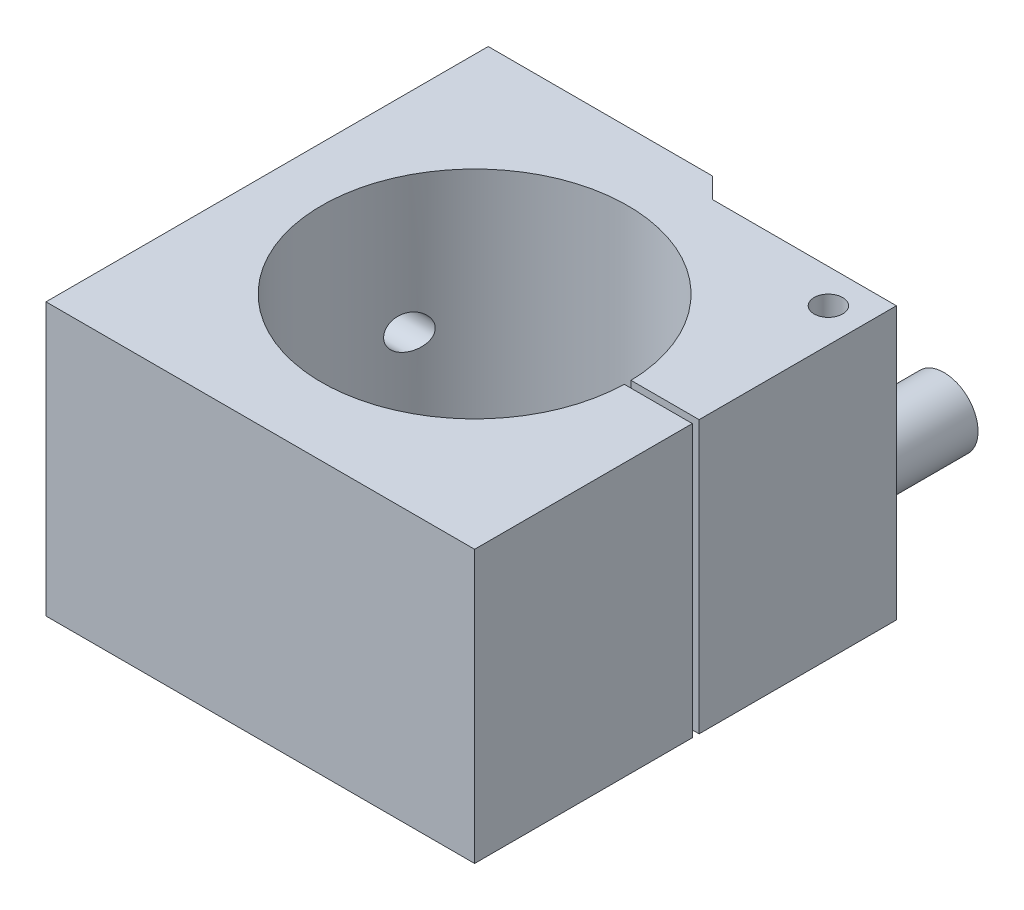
ISO-10303-21;
HEADER;
FILE_DESCRIPTION(('STEP AP214'),'2;1');
FILE_NAME('part.step','',(''),(''),'','','');
FILE_SCHEMA(('AUTOMOTIVE_DESIGN { 1 0 10303 214 1 1 1 1 }'));
ENDSEC;
DATA;
#1=APPLICATION_CONTEXT('core data for automotive mechanical design processes');
#2=APPLICATION_PROTOCOL_DEFINITION('international standard','automotive_design',2000,#1);
#3=PRODUCT_CONTEXT('',#1,'mechanical');
#4=PRODUCT('Part','Part','',(#3));
#5=PRODUCT_RELATED_PRODUCT_CATEGORY('part','',(#4));
#6=PRODUCT_DEFINITION_FORMATION('','',#4);
#7=PRODUCT_DEFINITION_CONTEXT('part definition',#1,'design');
#8=PRODUCT_DEFINITION('design','',#6,#7);
#9=PRODUCT_DEFINITION_SHAPE('','',#8);
#10=(LENGTH_UNIT() NAMED_UNIT(*) SI_UNIT(.MILLI.,.METRE.));
#11=(NAMED_UNIT(*) PLANE_ANGLE_UNIT() SI_UNIT($,.RADIAN.));
#12=(NAMED_UNIT(*) SI_UNIT($,.STERADIAN.) SOLID_ANGLE_UNIT());
#13=UNCERTAINTY_MEASURE_WITH_UNIT(LENGTH_MEASURE(1.E-05),#10,'distance_accuracy_value','');
#14=(GEOMETRIC_REPRESENTATION_CONTEXT(3) GLOBAL_UNCERTAINTY_ASSIGNED_CONTEXT((#13)) GLOBAL_UNIT_ASSIGNED_CONTEXT((#10,
#11,#12)) REPRESENTATION_CONTEXT('',''));
#15=CARTESIAN_POINT('',(0.,0.,0.));
#16=DIRECTION('',(0.,0.,1.));
#17=DIRECTION('',(1.,0.,0.));
#18=AXIS2_PLACEMENT_3D('',#15,#16,#17);
#19=CARTESIAN_POINT('',(32.5,40.,32.5));
#20=DIRECTION('',(-1.,0.,0.));
#21=DIRECTION('',(0.,0.,1.));
#22=AXIS2_PLACEMENT_3D('',#19,#20,#21);
#23=PLANE('',#22);
#24=DIRECTION('',(0.,-1.,0.));
#25=VECTOR('',#24,1.);
#26=CARTESIAN_POINT('',(32.5,40.,-29.5));
#27=LINE('',#26,#25);
#28=CARTESIAN_POINT('',(32.5,40.,-29.5));
#29=VERTEX_POINT('',#28);
#30=CARTESIAN_POINT('',(32.5,0.,-29.5));
#31=VERTEX_POINT('',#30);
#32=EDGE_CURVE('E280',#29,#31,#27,.T.);
#33=ORIENTED_EDGE('',*,*,#32,.F.);
#34=DIRECTION('',(0.,0.,-1.));
#35=VECTOR('',#34,1.);
#36=CARTESIAN_POINT('',(32.5,40.,32.5));
#37=LINE('',#36,#35);
#38=CARTESIAN_POINT('',(32.5,40.,-0.500000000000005));
#39=VERTEX_POINT('',#38);
#40=EDGE_CURVE('E270',#39,#29,#37,.T.);
#41=ORIENTED_EDGE('',*,*,#40,.F.);
#42=DIRECTION('',(0.,1.,0.));
#43=VECTOR('',#42,1.);
#44=CARTESIAN_POINT('',(32.5,0.,-0.500000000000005));
#45=LINE('',#44,#43);
#46=CARTESIAN_POINT('',(32.5,0.,-0.500000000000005));
#47=VERTEX_POINT('',#46);
#48=EDGE_CURVE('E311',#47,#39,#45,.T.);
#49=ORIENTED_EDGE('',*,*,#48,.F.);
#50=DIRECTION('',(0.,0.,-1.));
#51=VECTOR('',#50,1.);
#52=CARTESIAN_POINT('',(32.5,0.,32.5));
#53=LINE('',#52,#51);
#54=EDGE_CURVE('E258',#47,#31,#53,.T.);
#55=ORIENTED_EDGE('',*,*,#54,.T.);
#56=EDGE_LOOP('',(#33,#41,#49,#55));
#57=FACE_BOUND('',#56,.T.);
#58=ADVANCED_FACE('F41',(#57),#23,.F.);
#59=CARTESIAN_POINT('',(-32.5,40.,-32.5));
#60=DIRECTION('',(0.,0.,1.));
#61=DIRECTION('',(1.,0.,0.));
#62=AXIS2_PLACEMENT_3D('',#59,#60,#61);
#63=PLANE('',#62);
#64=DIRECTION('',(-1.,0.,0.));
#65=VECTOR('',#64,1.);
#66=CARTESIAN_POINT('',(-32.5,40.,-32.5));
#67=LINE('',#66,#65);
#68=CARTESIAN_POINT('',(2.49999999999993,40.,-32.5));
#69=VERTEX_POINT('',#68);
#70=CARTESIAN_POINT('',(-30.5,40.,-32.5));
#71=VERTEX_POINT('',#70);
#72=EDGE_CURVE('E120',#69,#71,#67,.T.);
#73=ORIENTED_EDGE('',*,*,#72,.F.);
#74=DIRECTION('',(0.,-1.,0.));
#75=VECTOR('',#74,1.);
#76=CARTESIAN_POINT('',(2.49999999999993,40.,-32.5));
#77=LINE('',#76,#75);
#78=CARTESIAN_POINT('',(2.49999999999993,0.,-32.5));
#79=VERTEX_POINT('',#78);
#80=EDGE_CURVE('E275',#69,#79,#77,.T.);
#81=ORIENTED_EDGE('',*,*,#80,.T.);
#82=DIRECTION('',(-1.,0.,0.));
#83=VECTOR('',#82,1.);
#84=CARTESIAN_POINT('',(-32.5,0.,-32.5));
#85=LINE('',#84,#83);
#86=CARTESIAN_POINT('',(-30.5,0.,-32.5));
#87=VERTEX_POINT('',#86);
#88=EDGE_CURVE('E136',#79,#87,#85,.T.);
#89=ORIENTED_EDGE('',*,*,#88,.T.);
#90=DIRECTION('',(0.,-1.,0.));
#91=VECTOR('',#90,1.);
#92=CARTESIAN_POINT('',(-30.5,40.,-32.5));
#93=LINE('',#92,#91);
#94=EDGE_CURVE('E133',#71,#87,#93,.T.);
#95=ORIENTED_EDGE('',*,*,#94,.F.);
#96=EDGE_LOOP('',(#73,#81,#89,#95));
#97=FACE_BOUND('',#96,.T.);
#98=ADVANCED_FACE('F134',(#97),#63,.F.);
#99=CARTESIAN_POINT('',(-32.5,40.,32.5));
#100=DIRECTION('',(0.,0.,-1.));
#101=DIRECTION('',(-1.,0.,0.));
#102=AXIS2_PLACEMENT_3D('',#99,#100,#101);
#103=PLANE('',#102);
#104=DIRECTION('',(1.,0.,0.));
#105=VECTOR('',#104,1.);
#106=CARTESIAN_POINT('',(-32.5,40.,32.5));
#107=LINE('',#106,#105);
#108=CARTESIAN_POINT('',(-30.5,40.,32.5));
#109=VERTEX_POINT('',#108);
#110=CARTESIAN_POINT('',(32.5,40.,32.5));
#111=VERTEX_POINT('',#110);
#112=EDGE_CURVE('E129',#109,#111,#107,.T.);
#113=ORIENTED_EDGE('',*,*,#112,.F.);
#114=DIRECTION('',(0.,1.,0.));
#115=VECTOR('',#114,1.);
#116=CARTESIAN_POINT('',(-30.5,0.,32.5));
#117=LINE('',#116,#115);
#118=CARTESIAN_POINT('',(-30.5,0.,32.5));
#119=VERTEX_POINT('',#118);
#120=EDGE_CURVE('E147',#119,#109,#117,.T.);
#121=ORIENTED_EDGE('',*,*,#120,.F.);
#122=DIRECTION('',(1.,0.,0.));
#123=VECTOR('',#122,1.);
#124=CARTESIAN_POINT('',(-32.5,0.,32.5));
#125=LINE('',#124,#123);
#126=CARTESIAN_POINT('',(32.5,0.,32.5));
#127=VERTEX_POINT('',#126);
#128=EDGE_CURVE('E262',#119,#127,#125,.T.);
#129=ORIENTED_EDGE('',*,*,#128,.T.);
#130=DIRECTION('',(0.,-1.,0.));
#131=VECTOR('',#130,1.);
#132=CARTESIAN_POINT('',(32.5,40.,32.5));
#133=LINE('',#132,#131);
#134=EDGE_CURVE('E255',#111,#127,#133,.T.);
#135=ORIENTED_EDGE('',*,*,#134,.F.);
#136=EDGE_LOOP('',(#113,#121,#129,#135));
#137=FACE_BOUND('',#136,.T.);
#138=ADVANCED_FACE('F235',(#137),#103,.F.);
#139=CARTESIAN_POINT('',(0.,40.,0.));
#140=DIRECTION('',(0.,-1.,0.));
#141=DIRECTION('',(0.,0.,-1.));
#142=AXIS2_PLACEMENT_3D('',#139,#140,#141);
#143=PLANE('',#142);
#144=CARTESIAN_POINT('',(27.5,40.,-24.5));
#145=DIRECTION('',(0.,1.,0.));
#146=DIRECTION('',(0.,0.,1.));
#147=AXIS2_PLACEMENT_3D('',#144,#145,#146);
#148=CIRCLE('',#147,2.1);
#149=CARTESIAN_POINT('',(27.5,40.,-22.4));
#150=VERTEX_POINT('',#149);
#151=EDGE_CURVE('E343',#150,#150,#148,.T.);
#152=ORIENTED_EDGE('',*,*,#151,.F.);
#153=EDGE_LOOP('',(#152));
#154=FACE_BOUND('',#153,.T.);
#155=DIRECTION('',(1.,0.,0.));
#156=VECTOR('',#155,1.);
#157=CARTESIAN_POINT('',(32.5,40.,-29.5));
#158=LINE('',#157,#156);
#159=CARTESIAN_POINT('',(5.4999999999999,40.,-29.5));
#160=VERTEX_POINT('',#159);
#161=EDGE_CURVE('E279',#160,#29,#158,.T.);
#162=ORIENTED_EDGE('',*,*,#161,.F.);
#163=DIRECTION('',(0.707106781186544,0.,0.707106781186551));
#164=VECTOR('',#163,1.);
#165=CARTESIAN_POINT('',(12.5,40.,-22.4999999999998));
#166=LINE('',#165,#164);
#167=EDGE_CURVE('E126',#160,#69,#166,.F.);
#168=ORIENTED_EDGE('',*,*,#167,.T.);
#169=ORIENTED_EDGE('',*,*,#72,.T.);
#170=DIRECTION('',(0.,0.,-1.));
#171=VECTOR('',#170,1.);
#172=CARTESIAN_POINT('',(-30.5,40.,32.5));
#173=LINE('',#172,#171);
#174=EDGE_CURVE('E124',#109,#71,#173,.T.);
#175=ORIENTED_EDGE('',*,*,#174,.F.);
#176=ORIENTED_EDGE('',*,*,#112,.T.);
#177=CARTESIAN_POINT('',(32.5,40.,0.499999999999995));
#178=VERTEX_POINT('',#177);
#179=EDGE_CURVE('E130',#111,#178,#37,.T.);
#180=ORIENTED_EDGE('',*,*,#179,.T.);
#181=DIRECTION('',(1.,0.,0.));
#182=VECTOR('',#181,1.);
#183=CARTESIAN_POINT('',(-32.501,40.,0.499999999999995));
#184=LINE('',#183,#182);
#185=CARTESIAN_POINT('',(22.494443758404,40.,0.49999999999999));
#186=VERTEX_POINT('',#185);
#187=EDGE_CURVE('E307',#186,#178,#184,.T.);
#188=ORIENTED_EDGE('',*,*,#187,.F.);
#189=CARTESIAN_POINT('',(0.,40.,0.));
#190=DIRECTION('',(0.,1.,0.));
#191=DIRECTION('',(0.,0.,1.));
#192=AXIS2_PLACEMENT_3D('',#189,#190,#191);
#193=CIRCLE('',#192,22.5);
#194=CARTESIAN_POINT('',(22.494443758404,40.,-0.500000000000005));
#195=VERTEX_POINT('',#194);
#196=EDGE_CURVE('E265',#195,#186,#193,.T.);
#197=ORIENTED_EDGE('',*,*,#196,.F.);
#198=DIRECTION('',(1.,0.,0.));
#199=VECTOR('',#198,1.);
#200=CARTESIAN_POINT('',(-32.501,40.,-0.500000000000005));
#201=LINE('',#200,#199);
#202=EDGE_CURVE('E292',#195,#39,#201,.T.);
#203=ORIENTED_EDGE('',*,*,#202,.T.);
#204=ORIENTED_EDGE('',*,*,#40,.T.);
#205=EDGE_LOOP('',(#162,#168,#169,#175,#176,#180,#188,#197,#203,#204));
#206=FACE_BOUND('',#205,.T.);
#207=ADVANCED_FACE('F122',(#154,#206),#143,.F.);
#208=CARTESIAN_POINT('',(0.,0.,0.));
#209=DIRECTION('',(0.,-1.,0.));
#210=DIRECTION('',(0.,0.,-1.));
#211=AXIS2_PLACEMENT_3D('',#208,#209,#210);
#212=PLANE('',#211);
#213=DIRECTION('',(-0.707106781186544,0.,-0.707106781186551));
#214=VECTOR('',#213,1.);
#215=CARTESIAN_POINT('',(17.5,0.,-17.4999999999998));
#216=LINE('',#215,#214);
#217=CARTESIAN_POINT('',(5.4999999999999,0.,-29.5));
#218=VERTEX_POINT('',#217);
#219=EDGE_CURVE('E51',#79,#218,#216,.F.);
#220=ORIENTED_EDGE('',*,*,#219,.T.);
#221=DIRECTION('',(-1.,0.,0.));
#222=VECTOR('',#221,1.);
#223=CARTESIAN_POINT('',(32.5,0.,-29.5));
#224=LINE('',#223,#222);
#225=EDGE_CURVE('E57',#31,#218,#224,.T.);
#226=ORIENTED_EDGE('',*,*,#225,.F.);
#227=ORIENTED_EDGE('',*,*,#54,.F.);
#228=DIRECTION('',(1.,0.,0.));
#229=VECTOR('',#228,1.);
#230=CARTESIAN_POINT('',(-32.501,0.,-0.500000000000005));
#231=LINE('',#230,#229);
#232=CARTESIAN_POINT('',(22.494443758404,0.,-0.500000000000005));
#233=VERTEX_POINT('',#232);
#234=EDGE_CURVE('E314',#233,#47,#231,.T.);
#235=ORIENTED_EDGE('',*,*,#234,.F.);
#236=CARTESIAN_POINT('',(0.,0.,0.));
#237=DIRECTION('',(0.,-1.,0.));
#238=DIRECTION('',(0.,0.,-1.));
#239=AXIS2_PLACEMENT_3D('',#236,#237,#238);
#240=CIRCLE('',#239,22.5);
#241=CARTESIAN_POINT('',(22.494443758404,0.,0.49999999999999));
#242=VERTEX_POINT('',#241);
#243=EDGE_CURVE('E297',#233,#242,#240,.F.);
#244=ORIENTED_EDGE('',*,*,#243,.T.);
#245=DIRECTION('',(1.,0.,0.));
#246=VECTOR('',#245,1.);
#247=CARTESIAN_POINT('',(-32.501,0.,0.49999999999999));
#248=LINE('',#247,#246);
#249=CARTESIAN_POINT('',(32.5,0.,0.49999999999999));
#250=VERTEX_POINT('',#249);
#251=EDGE_CURVE('E310',#242,#250,#248,.T.);
#252=ORIENTED_EDGE('',*,*,#251,.T.);
#253=EDGE_CURVE('E250',#127,#250,#53,.T.);
#254=ORIENTED_EDGE('',*,*,#253,.F.);
#255=ORIENTED_EDGE('',*,*,#128,.F.);
#256=DIRECTION('',(0.,0.,1.));
#257=VECTOR('',#256,1.);
#258=CARTESIAN_POINT('',(-30.5,0.,-32.5));
#259=LINE('',#258,#257);
#260=EDGE_CURVE('E141',#87,#119,#259,.T.);
#261=ORIENTED_EDGE('',*,*,#260,.F.);
#262=ORIENTED_EDGE('',*,*,#88,.F.);
#263=EDGE_LOOP('',(#220,#226,#227,#235,#244,#252,#254,#255,#261,#262));
#264=FACE_BOUND('',#263,.T.);
#265=ADVANCED_FACE('F239',(#264),#212,.T.);
#266=ORIENTED_EDGE('',*,*,#253,.T.);
#267=DIRECTION('',(0.,-1.,0.));
#268=VECTOR('',#267,1.);
#269=CARTESIAN_POINT('',(32.5,40.,0.499999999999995));
#270=LINE('',#269,#268);
#271=EDGE_CURVE('E252',#178,#250,#270,.T.);
#272=ORIENTED_EDGE('',*,*,#271,.F.);
#273=ORIENTED_EDGE('',*,*,#179,.F.);
#274=ORIENTED_EDGE('',*,*,#134,.T.);
#275=EDGE_LOOP('',(#266,#272,#273,#274));
#276=FACE_BOUND('',#275,.T.);
#277=ADVANCED_FACE('F226',(#276),#23,.F.);
#278=CARTESIAN_POINT('',(0.,-0.001000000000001,0.));
#279=DIRECTION('',(0.,1.,0.));
#280=DIRECTION('',(0.,0.,1.));
#281=AXIS2_PLACEMENT_3D('',#278,#279,#280);
#282=CYLINDRICAL_SURFACE('',#281,22.5);
#283=CARTESIAN_POINT('',(-21.1231508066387,20.,-7.75));
#284=CARTESIAN_POINT('',(-21.12315005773,20.1335678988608,-7.75000416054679));
#285=CARTESIAN_POINT('',(-21.1192178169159,20.2671847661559,-7.76074551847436));
#286=CARTESIAN_POINT('',(-21.1035269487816,20.5305947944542,-7.80331001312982));
#287=CARTESIAN_POINT('',(-21.0917634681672,20.6603855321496,-7.83514622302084));
#288=CARTESIAN_POINT('',(-21.0605658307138,20.9122747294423,-7.91861950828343));
#289=CARTESIAN_POINT('',(-21.0411407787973,21.0343821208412,-7.97023307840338));
#290=CARTESIAN_POINT('',(-20.9948758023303,21.2678211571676,-8.09131448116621));
#291=CARTESIAN_POINT('',(-20.9680363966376,21.379153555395,-8.16078106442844));
#292=CARTESIAN_POINT('',(-20.9067240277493,21.5904642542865,-8.31661075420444));
#293=CARTESIAN_POINT('',(-20.8721113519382,21.690176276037,-8.40327921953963));
#294=CARTESIAN_POINT('',(-20.7961212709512,21.8735571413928,-8.58961312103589));
#295=CARTESIAN_POINT('',(-20.7547424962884,21.9572227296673,-8.68928118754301));
#296=CARTESIAN_POINT('',(-20.6633768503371,22.1113966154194,-8.90445145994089));
#297=CARTESIAN_POINT('',(-20.6130341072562,22.1808851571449,-9.02053198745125));
#298=CARTESIAN_POINT('',(-20.5065180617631,22.2995743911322,-9.26012526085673));
#299=CARTESIAN_POINT('',(-20.4503428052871,22.3487682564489,-9.38364049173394));
#300=CARTESIAN_POINT('',(-20.3283916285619,22.4298994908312,-9.64515199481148));
#301=CARTESIAN_POINT('',(-20.2622059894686,22.4600778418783,-9.78350215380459));
#302=CARTESIAN_POINT('',(-20.1257183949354,22.4968058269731,-10.0612846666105));
#303=CARTESIAN_POINT('',(-20.0554149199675,22.5033466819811,-10.2007174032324));
#304=CARTESIAN_POINT('',(-19.9057496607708,22.4930306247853,-10.4899935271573));
#305=CARTESIAN_POINT('',(-19.8261444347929,22.4739990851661,-10.6396349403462));
#306=CARTESIAN_POINT('',(-19.6660358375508,22.4096466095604,-10.9327478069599));
#307=CARTESIAN_POINT('',(-19.5855318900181,22.3643077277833,-11.0762149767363));
#308=CARTESIAN_POINT('',(-19.4214832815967,22.2449418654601,-11.3615400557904));
#309=CARTESIAN_POINT('',(-19.3380320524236,22.1694073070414,-11.5028249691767));
#310=CARTESIAN_POINT('',(-19.1763562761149,21.9910440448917,-11.770376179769));
#311=CARTESIAN_POINT('',(-19.098127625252,21.8882370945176,-11.8966543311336));
#312=CARTESIAN_POINT('',(-18.9654464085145,21.6792453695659,-12.1067832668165));
#313=CARTESIAN_POINT('',(-18.909327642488,21.5775992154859,-12.1941102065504));
#314=CARTESIAN_POINT('',(-18.805896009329,21.3585014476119,-12.3530261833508));
#315=CARTESIAN_POINT('',(-18.7585791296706,21.2410570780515,-12.424622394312));
#316=CARTESIAN_POINT('',(-18.6963581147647,21.0543186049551,-12.5178918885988));
#317=CARTESIAN_POINT('',(-18.6770065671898,20.989981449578,-12.5467296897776));
#318=CARTESIAN_POINT('',(-18.6417105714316,20.8583030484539,-12.5991119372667));
#319=CARTESIAN_POINT('',(-18.6257642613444,20.7909634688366,-12.6226592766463));
#320=CARTESIAN_POINT('',(-18.5976477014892,20.6538294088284,-12.664048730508));
#321=CARTESIAN_POINT('',(-18.5854749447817,20.5840365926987,-12.6818946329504));
#322=CARTESIAN_POINT('',(-18.5651938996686,20.442632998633,-12.7115652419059));
#323=CARTESIAN_POINT('',(-18.5570848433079,20.3710225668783,-12.7233910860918));
#324=CARTESIAN_POINT('',(-18.5409212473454,20.1752256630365,-12.7469455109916));
#325=CARTESIAN_POINT('',(-18.5370099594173,20.0498802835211,-12.7526191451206));
#326=CARTESIAN_POINT('',(-18.5421589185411,19.8001237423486,-12.7451304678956));
#327=CARTESIAN_POINT('',(-18.5512149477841,19.6757122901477,-12.731974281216));
#328=CARTESIAN_POINT('',(-18.5804771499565,19.4400632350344,-12.6892264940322));
#329=CARTESIAN_POINT('',(-18.5998799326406,19.328506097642,-12.6608182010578));
#330=CARTESIAN_POINT('',(-18.6480141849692,19.1121665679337,-12.5898131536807));
#331=CARTESIAN_POINT('',(-18.676747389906,19.007385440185,-12.5472137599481));
#332=CARTESIAN_POINT('',(-18.7443973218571,18.7990787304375,-12.445944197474));
#333=CARTESIAN_POINT('',(-18.7839073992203,18.696211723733,-12.3863228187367));
#334=CARTESIAN_POINT('',(-18.8699410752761,18.5018893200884,-12.2548560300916));
#335=CARTESIAN_POINT('',(-18.9164681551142,18.4104396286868,-12.1830045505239));
#336=CARTESIAN_POINT('',(-19.0223214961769,18.2266712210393,-12.0171696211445));
#337=CARTESIAN_POINT('',(-19.0825151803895,18.1363913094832,-11.9214818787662));
#338=CARTESIAN_POINT('',(-19.2074781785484,17.97299962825,-11.719085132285));
#339=CARTESIAN_POINT('',(-19.2722502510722,17.8998983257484,-11.6123694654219));
#340=CARTESIAN_POINT('',(-19.4145541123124,17.7615701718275,-11.3730943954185));
#341=CARTESIAN_POINT('',(-19.4925163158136,17.6992830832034,-11.2390844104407));
#342=CARTESIAN_POINT('',(-19.6493163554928,17.5992165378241,-10.9626482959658));
#343=CARTESIAN_POINT('',(-19.7281546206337,17.5614496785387,-10.8202178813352));
#344=CARTESIAN_POINT('',(-19.8906047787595,17.5094363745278,-10.5188088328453));
#345=CARTESIAN_POINT('',(-19.9741077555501,17.4972605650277,-10.3594071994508));
#346=CARTESIAN_POINT('',(-20.1370104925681,17.5037700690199,-10.0390778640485));
#347=CARTESIAN_POINT('',(-20.2164103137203,17.52245492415,-9.87815018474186));
#348=CARTESIAN_POINT('',(-20.3668396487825,17.5907143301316,-9.56406785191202));
#349=CARTESIAN_POINT('',(-20.4380304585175,17.6394928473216,-9.41081957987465));
#350=CARTESIAN_POINT('',(-20.5722680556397,17.7673361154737,-9.11363495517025));
#351=CARTESIAN_POINT('',(-20.6353198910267,17.846381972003,-8.96969285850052));
#352=CARTESIAN_POINT('',(-20.7462954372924,18.0251104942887,-8.70973233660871));
#353=CARTESIAN_POINT('',(-20.7950689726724,18.1223046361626,-8.59236724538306));
#354=CARTESIAN_POINT('',(-20.8832963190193,18.3386062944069,-8.37565758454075));
#355=CARTESIAN_POINT('',(-20.9227546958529,18.4577030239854,-8.27630419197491));
#356=CARTESIAN_POINT('',(-20.9883415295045,18.7024153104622,-8.10844726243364));
#357=CARTESIAN_POINT('',(-21.0153614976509,18.8264271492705,-8.03794825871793));
#358=CARTESIAN_POINT('',(-21.0605720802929,19.0859201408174,-7.91873728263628));
#359=CARTESIAN_POINT('',(-21.0787725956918,19.221388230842,-7.87000088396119));
#360=CARTESIAN_POINT('',(-21.1026533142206,19.4643142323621,-7.80569432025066));
#361=CARTESIAN_POINT('',(-21.11033369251,19.5702175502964,-7.78485900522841));
#362=CARTESIAN_POINT('',(-21.1205825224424,19.7840700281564,-7.7570107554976));
#363=CARTESIAN_POINT('',(-21.1231514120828,19.8920190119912,-7.74999663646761));
#364=CARTESIAN_POINT('',(-21.1231508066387,20.,-7.75));
#365=B_SPLINE_CURVE_WITH_KNOTS('',3,(#283,#284,#285,#286,#287,#288,#289,#290,#291,#292,#293,
#294,#295,#296,#297,#298,#299,#300,#301,#302,#303,#304,#305,#306,#307,#308,#309,#310,#311,#312,
#313,#314,#315,#316,#317,#318,#319,#320,#321,#322,#323,#324,#325,#326,#327,#328,#329,#330,#331,
#332,#333,#334,#335,#336,#337,#338,#339,#340,#341,#342,#343,#344,#345,#346,#347,#348,#349,#350,
#351,#352,#353,#354,#355,#356,#357,#358,#359,#360,#361,#362,#363,#364),.UNSPECIFIED.,.T.,.F.,(4,
2,2,2,2,2,2,2,2,2,2,2,2,2,2,2,2,2,2,2,2,2,2,2,2,2,2,2,2,2,2,2,2,2,2,2,2,2,2,2,4),(0.,
0.400305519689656,0.800859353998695,1.20093860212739,1.60098985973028,2.00890677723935,
2.41690636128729,2.84812524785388,3.27948907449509,3.74644944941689,4.21358323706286,
4.72306024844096,5.23288521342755,5.77219710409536,6.31108010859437,6.74524457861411,
7.17921063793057,7.39827100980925,7.61721129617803,7.83600581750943,8.05475897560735,
8.42914363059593,8.80340653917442,9.15211967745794,9.50089770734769,9.87531592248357,
10.2499205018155,10.6822664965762,11.1148752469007,11.6140121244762,12.113405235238,
12.6518574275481,13.1903016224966,13.7150798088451,14.2395309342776,14.7169178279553,
15.1940702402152,15.627392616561,16.0602274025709,16.3838762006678,16.7074972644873),.UNSPECIFIED.);
#366=CARTESIAN_POINT('',(-21.1231508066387,20.,-7.75));
#367=VERTEX_POINT('',#366);
#368=EDGE_CURVE('E170',#367,#367,#365,.T.);
#369=ORIENTED_EDGE('',*,*,#368,.T.);
#370=EDGE_LOOP('',(#369));
#371=FACE_BOUND('',#370,.T.);
#372=CARTESIAN_POINT('',(-18.5388106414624,20.,12.75));
#373=CARTESIAN_POINT('',(-18.5388157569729,20.1236585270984,12.7499939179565));
#374=CARTESIAN_POINT('',(-18.5451698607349,20.2473707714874,12.7407686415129));
#375=CARTESIAN_POINT('',(-18.5700836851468,20.4909011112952,12.7044264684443));
#376=CARTESIAN_POINT('',(-18.5886532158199,20.6107159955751,12.6772951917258));
#377=CARTESIAN_POINT('',(-18.6365028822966,20.842556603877,12.6068451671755));
#378=CARTESIAN_POINT('',(-18.6657350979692,20.954614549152,12.5635988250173));
#379=CARTESIAN_POINT('',(-18.7331064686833,21.1692089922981,12.4629200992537));
#380=CARTESIAN_POINT('',(-18.7712474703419,21.2717435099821,12.405484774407));
#381=CARTESIAN_POINT('',(-18.8576849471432,21.4731186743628,12.2737266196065));
#382=CARTESIAN_POINT('',(-18.9065294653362,21.5711015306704,12.1984585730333));
#383=CARTESIAN_POINT('',(-19.0101743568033,21.7532887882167,12.0363009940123));
#384=CARTESIAN_POINT('',(-19.0649774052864,21.8374869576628,11.9494062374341));
#385=CARTESIAN_POINT('',(-19.1882066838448,22.0043654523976,11.7506828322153));
#386=CARTESIAN_POINT('',(-19.2573772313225,22.0844292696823,11.6371156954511));
#387=CARTESIAN_POINT('',(-19.3988062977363,22.2241737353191,11.3997997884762));
#388=CARTESIAN_POINT('',(-19.4710667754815,22.2838412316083,11.2760445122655));
#389=CARTESIAN_POINT('',(-19.6258098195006,22.3883109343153,11.0047672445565));
#390=CARTESIAN_POINT('',(-19.7084279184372,22.4302732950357,10.8562202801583));
#391=CARTESIAN_POINT('',(-19.8723371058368,22.4863276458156,10.5531944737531));
#392=CARTESIAN_POINT('',(-19.9536277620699,22.5004107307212,10.3987137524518));
#393=CARTESIAN_POINT('',(-20.1149397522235,22.4995587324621,10.0832276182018));
#394=CARTESIAN_POINT('',(-20.1948505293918,22.4837437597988,9.92216519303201));
#395=CARTESIAN_POINT('',(-20.3484211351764,22.4203615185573,9.60328288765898));
#396=CARTESIAN_POINT('',(-20.4220830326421,22.3728048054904,9.44546194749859));
#397=CARTESIAN_POINT('',(-20.5566344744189,22.2497582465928,9.14875263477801));
#398=CARTESIAN_POINT('',(-20.6180347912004,22.1762022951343,9.00929751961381));
#399=CARTESIAN_POINT('',(-20.7318111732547,22.0019881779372,8.74430039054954));
#400=CARTESIAN_POINT('',(-20.7841933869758,21.9013485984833,8.61874891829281));
#401=CARTESIAN_POINT('',(-20.8739972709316,21.6864687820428,8.3987504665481));
#402=CARTESIAN_POINT('',(-20.9123796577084,21.5745114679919,8.30246429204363));
#403=CARTESIAN_POINT('',(-20.9799622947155,21.3335101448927,8.13017657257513));
#404=CARTESIAN_POINT('',(-21.0091673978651,21.2044752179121,8.05416431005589));
#405=CARTESIAN_POINT('',(-21.0559362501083,20.9442104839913,7.93105013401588));
#406=CARTESIAN_POINT('',(-21.0742411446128,20.8139714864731,7.882129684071));
#407=CARTESIAN_POINT('',(-21.1023852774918,20.5463351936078,7.8064707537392));
#408=CARTESIAN_POINT('',(-21.1122270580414,20.408940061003,7.7797256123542));
#409=CARTESIAN_POINT('',(-21.1230802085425,20.1373850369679,7.75020744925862));
#410=CARTESIAN_POINT('',(-21.124459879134,20.0033474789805,7.74643464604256));
#411=CARTESIAN_POINT('',(-21.119357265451,19.7365500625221,7.76033526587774));
#412=CARTESIAN_POINT('',(-21.1128758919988,19.6037900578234,7.77800620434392));
#413=CARTESIAN_POINT('',(-21.0922432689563,19.3448378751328,7.83378155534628));
#414=CARTESIAN_POINT('',(-21.0781787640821,19.2185887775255,7.87165481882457));
#415=CARTESIAN_POINT('',(-21.0426068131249,18.9745007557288,7.96625610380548));
#416=CARTESIAN_POINT('',(-21.0210991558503,18.8566620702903,8.02298466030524));
#417=CARTESIAN_POINT('',(-20.9704783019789,18.6303898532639,8.1543891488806));
#418=CARTESIAN_POINT('',(-20.9412378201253,18.5221585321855,8.22936359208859));
#419=CARTESIAN_POINT('',(-20.8757717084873,18.3199878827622,8.39404502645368));
#420=CARTESIAN_POINT('',(-20.8395449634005,18.2260508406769,8.48375436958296));
#421=CARTESIAN_POINT('',(-20.7588370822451,18.0502889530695,8.67942225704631));
#422=CARTESIAN_POINT('',(-20.714050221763,17.9692314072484,8.78594278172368));
#423=CARTESIAN_POINT('',(-20.6182545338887,17.8260432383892,9.00845475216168));
#424=CARTESIAN_POINT('',(-20.5672439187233,17.7639180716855,9.12444891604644));
#425=CARTESIAN_POINT('',(-20.455924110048,17.6552703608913,9.37149050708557));
#426=CARTESIAN_POINT('',(-20.3952052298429,17.6102559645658,9.5030155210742));
#427=CARTESIAN_POINT('',(-20.2689267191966,17.5427668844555,9.76946156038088));
#428=CARTESIAN_POINT('',(-20.2033651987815,17.5203010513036,9.90438389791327));
#429=CARTESIAN_POINT('',(-20.0626176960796,17.4964347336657,10.1866789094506));
#430=CARTESIAN_POINT('',(-19.9870993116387,17.497142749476,10.334064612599));
#431=CARTESIAN_POINT('',(-19.8338079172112,17.5240043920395,10.6253091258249));
#432=CARTESIAN_POINT('',(-19.7560340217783,17.5501681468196,10.7691665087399));
#433=CARTESIAN_POINT('',(-19.5944083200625,17.6299158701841,11.0606944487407));
#434=CARTESIAN_POINT('',(-19.5105402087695,17.6854177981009,11.2078352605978));
#435=CARTESIAN_POINT('',(-19.3454326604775,17.8237666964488,11.4904768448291));
#436=CARTESIAN_POINT('',(-19.2641951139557,17.9066328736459,11.6259693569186));
#437=CARTESIAN_POINT('',(-19.1076779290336,18.0989518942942,11.8814626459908));
#438=CARTESIAN_POINT('',(-19.0324164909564,18.2084821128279,12.0014167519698));
#439=CARTESIAN_POINT('',(-18.8926209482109,18.4525316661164,12.2202994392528));
#440=CARTESIAN_POINT('',(-18.828066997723,18.5870037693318,12.3192670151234));
#441=CARTESIAN_POINT('',(-18.7309359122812,18.83684784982,12.4662549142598));
#442=CARTESIAN_POINT('',(-18.694474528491,18.9469171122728,12.5207724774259));
#443=CARTESIAN_POINT('',(-18.6319309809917,19.1763621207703,12.6136551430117));
#444=CARTESIAN_POINT('',(-18.605831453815,19.2957218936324,12.6520472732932));
#445=CARTESIAN_POINT('',(-18.5704128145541,19.5126198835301,12.7039565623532));
#446=CARTESIAN_POINT('',(-18.5586183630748,19.6088869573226,12.7211587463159));
#447=CARTESIAN_POINT('',(-18.5428149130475,19.8034245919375,12.7441833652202));
#448=CARTESIAN_POINT('',(-18.5388065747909,19.9016953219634,12.7500048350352));
#449=CARTESIAN_POINT('',(-18.5388106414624,20.,12.75));
#450=B_SPLINE_CURVE_WITH_KNOTS('',3,(#372,#373,#374,#375,#376,#377,#378,#379,#380,#381,#382,
#383,#384,#385,#386,#387,#388,#389,#390,#391,#392,#393,#394,#395,#396,#397,#398,#399,#400,#401,
#402,#403,#404,#405,#406,#407,#408,#409,#410,#411,#412,#413,#414,#415,#416,#417,#418,#419,#420,
#421,#422,#423,#424,#425,#426,#427,#428,#429,#430,#431,#432,#433,#434,#435,#436,#437,#438,#439,
#440,#441,#442,#443,#444,#445,#446,#447,#448,#449),.UNSPECIFIED.,.T.,.F.,(4,2,2,2,2,2,2,2,2,2,2,
2,2,2,2,2,2,2,2,2,2,2,2,2,2,2,2,2,2,2,2,2,2,2,2,2,2,2,4),(0.,0.37058004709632,0.741458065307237,
1.11068942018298,1.47999737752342,1.87708066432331,2.27434297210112,2.73814650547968,
3.20224854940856,3.725130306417,4.24817905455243,4.7868609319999,5.32536376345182,
5.83017352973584,6.33463774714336,6.78991436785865,7.24494983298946,7.66379428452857,
8.08251287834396,8.48287007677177,8.88318089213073,9.27900673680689,9.67484381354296,
10.0776528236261,10.480526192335,10.902151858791,11.3238989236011,11.7770821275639,
12.2304431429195,12.725159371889,13.2200725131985,13.7522856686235,14.2848731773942,
14.8190249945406,15.3521754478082,15.7350226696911,16.1172256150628,16.4118002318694,
16.7063998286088),.UNSPECIFIED.);
#451=CARTESIAN_POINT('',(-18.5388106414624,20.,12.75));
#452=VERTEX_POINT('',#451);
#453=EDGE_CURVE('E161',#452,#452,#450,.T.);
#454=ORIENTED_EDGE('',*,*,#453,.T.);
#455=EDGE_LOOP('',(#454));
#456=FACE_BOUND('',#455,.T.);
#457=ORIENTED_EDGE('',*,*,#243,.F.);
#458=DIRECTION('',(0.,1.,0.));
#459=VECTOR('',#458,1.);
#460=CARTESIAN_POINT('',(22.494443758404,-0.001000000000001,-0.500000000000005));
#461=LINE('',#460,#459);
#462=EDGE_CURVE('E283',#195,#233,#461,.F.);
#463=ORIENTED_EDGE('',*,*,#462,.F.);
#464=ORIENTED_EDGE('',*,*,#196,.T.);
#465=DIRECTION('',(0.,1.,0.));
#466=VECTOR('',#465,1.);
#467=CARTESIAN_POINT('',(22.494443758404,-0.00100000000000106,0.49999999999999));
#468=LINE('',#467,#466);
#469=EDGE_CURVE('E301',#242,#186,#468,.T.);
#470=ORIENTED_EDGE('',*,*,#469,.F.);
#471=EDGE_LOOP('',(#457,#463,#464,#470));
#472=FACE_BOUND('',#471,.T.);
#473=ADVANCED_FACE('F176',(#371,#456,#472),#282,.F.);
#474=CARTESIAN_POINT('',(-32.501,40.,0.499999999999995));
#475=DIRECTION('',(0.,0.,1.));
#476=DIRECTION('',(0.,-1.,0.));
#477=AXIS2_PLACEMENT_3D('',#474,#475,#476);
#478=PLANE('',#477);
#479=ORIENTED_EDGE('',*,*,#469,.T.);
#480=ORIENTED_EDGE('',*,*,#187,.T.);
#481=ORIENTED_EDGE('',*,*,#271,.T.);
#482=ORIENTED_EDGE('',*,*,#251,.F.);
#483=EDGE_LOOP('',(#479,#480,#481,#482));
#484=FACE_BOUND('',#483,.T.);
#485=ADVANCED_FACE('F218',(#484),#478,.F.);
#486=CARTESIAN_POINT('',(-32.501,0.,-0.500000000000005));
#487=DIRECTION('',(0.,0.,-1.));
#488=DIRECTION('',(0.,1.,0.));
#489=AXIS2_PLACEMENT_3D('',#486,#487,#488);
#490=PLANE('',#489);
#491=ORIENTED_EDGE('',*,*,#462,.T.);
#492=ORIENTED_EDGE('',*,*,#234,.T.);
#493=ORIENTED_EDGE('',*,*,#48,.T.);
#494=ORIENTED_EDGE('',*,*,#202,.F.);
#495=EDGE_LOOP('',(#491,#492,#493,#494));
#496=FACE_BOUND('',#495,.T.);
#497=ADVANCED_FACE('F215',(#496),#490,.F.);
#498=CARTESIAN_POINT('',(0.,0.,-29.5));
#499=DIRECTION('',(0.,0.,-1.));
#500=DIRECTION('',(-1.,0.,0.));
#501=AXIS2_PLACEMENT_3D('',#498,#499,#500);
#502=PLANE('',#501);
#503=CARTESIAN_POINT('',(13.4999999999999,32.,-29.5));
#504=DIRECTION('',(0.,0.,-1.));
#505=DIRECTION('',(-1.,0.,0.));
#506=AXIS2_PLACEMENT_3D('',#503,#504,#505);
#507=CIRCLE('',#506,5.);
#508=CARTESIAN_POINT('',(8.4999999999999,32.,-29.5));
#509=VERTEX_POINT('',#508);
#510=EDGE_CURVE('E335',#509,#509,#507,.T.);
#511=ORIENTED_EDGE('',*,*,#510,.F.);
#512=EDGE_LOOP('',(#511));
#513=FACE_BOUND('',#512,.T.);
#514=CARTESIAN_POINT('',(19.5,10.,-29.5));
#515=DIRECTION('',(0.,0.,-1.));
#516=DIRECTION('',(-1.,0.,0.));
#517=AXIS2_PLACEMENT_3D('',#514,#515,#516);
#518=CIRCLE('',#517,5.);
#519=CARTESIAN_POINT('',(14.5,10.,-29.5));
#520=VERTEX_POINT('',#519);
#521=EDGE_CURVE('E327',#520,#520,#518,.T.);
#522=ORIENTED_EDGE('',*,*,#521,.F.);
#523=EDGE_LOOP('',(#522));
#524=FACE_BOUND('',#523,.T.);
#525=ORIENTED_EDGE('',*,*,#32,.T.);
#526=ORIENTED_EDGE('',*,*,#225,.T.);
#527=DIRECTION('',(0.,-1.,0.));
#528=VECTOR('',#527,1.);
#529=CARTESIAN_POINT('',(5.4999999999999,40.,-29.5));
#530=LINE('',#529,#528);
#531=EDGE_CURVE('E11',#218,#160,#530,.F.);
#532=ORIENTED_EDGE('',*,*,#531,.T.);
#533=ORIENTED_EDGE('',*,*,#161,.T.);
#534=EDGE_LOOP('',(#525,#526,#532,#533));
#535=FACE_BOUND('',#534,.T.);
#536=ADVANCED_FACE('F212',(#513,#524,#535),#502,.T.);
#537=CARTESIAN_POINT('',(12.5,40.,-22.4999999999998));
#538=DIRECTION('',(-0.707106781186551,0.,0.707106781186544));
#539=DIRECTION('',(0.,1.,0.));
#540=AXIS2_PLACEMENT_3D('',#537,#538,#539);
#541=PLANE('',#540);
#542=ORIENTED_EDGE('',*,*,#219,.F.);
#543=ORIENTED_EDGE('',*,*,#80,.F.);
#544=ORIENTED_EDGE('',*,*,#167,.F.);
#545=ORIENTED_EDGE('',*,*,#531,.F.);
#546=EDGE_LOOP('',(#542,#543,#544,#545));
#547=FACE_BOUND('',#546,.T.);
#548=ADVANCED_FACE('F44',(#547),#541,.F.);
#549=CARTESIAN_POINT('',(19.5,10.,-49.5));
#550=DIRECTION('',(0.,0.,1.));
#551=DIRECTION('',(1.,0.,0.));
#552=AXIS2_PLACEMENT_3D('',#549,#550,#551);
#553=CYLINDRICAL_SURFACE('',#552,5.);
#554=CARTESIAN_POINT('',(19.5,10.,-49.5));
#555=DIRECTION('',(0.,0.,-1.));
#556=DIRECTION('',(-1.,0.,0.));
#557=AXIS2_PLACEMENT_3D('',#554,#555,#556);
#558=CIRCLE('',#557,5.);
#559=CARTESIAN_POINT('',(14.5,10.,-49.5));
#560=VERTEX_POINT('',#559);
#561=EDGE_CURVE('E288',#560,#560,#558,.T.);
#562=ORIENTED_EDGE('',*,*,#561,.F.);
#563=EDGE_LOOP('',(#562));
#564=FACE_BOUND('',#563,.T.);
#565=ORIENTED_EDGE('',*,*,#521,.T.);
#566=EDGE_LOOP('',(#565));
#567=FACE_BOUND('',#566,.T.);
#568=ADVANCED_FACE('F207',(#564,#567),#553,.T.);
#569=CARTESIAN_POINT('',(19.5,10.,-49.5));
#570=DIRECTION('',(0.,0.,-1.));
#571=DIRECTION('',(-1.,0.,0.));
#572=AXIS2_PLACEMENT_3D('',#569,#570,#571);
#573=PLANE('',#572);
#574=ORIENTED_EDGE('',*,*,#561,.T.);
#575=EDGE_LOOP('',(#574));
#576=FACE_BOUND('',#575,.T.);
#577=ADVANCED_FACE('F203',(#576),#573,.T.);
#578=CARTESIAN_POINT('',(13.4999999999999,32.,-22.));
#579=DIRECTION('',(0.,0.,-1.));
#580=DIRECTION('',(-1.,0.,0.));
#581=AXIS2_PLACEMENT_3D('',#578,#579,#580);
#582=CYLINDRICAL_SURFACE('',#581,5.);
#583=CARTESIAN_POINT('',(13.4999999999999,32.,-22.));
#584=DIRECTION('',(0.,0.,-1.));
#585=DIRECTION('',(-1.,0.,0.));
#586=AXIS2_PLACEMENT_3D('',#583,#584,#585);
#587=CIRCLE('',#586,5.);
#588=CARTESIAN_POINT('',(8.4999999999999,32.,-22.));
#589=VERTEX_POINT('',#588);
#590=EDGE_CURVE('E331',#589,#589,#587,.T.);
#591=ORIENTED_EDGE('',*,*,#590,.F.);
#592=EDGE_LOOP('',(#591));
#593=FACE_BOUND('',#592,.T.);
#594=ORIENTED_EDGE('',*,*,#510,.T.);
#595=EDGE_LOOP('',(#594));
#596=FACE_BOUND('',#595,.T.);
#597=ADVANCED_FACE('F199',(#593,#596),#582,.F.);
#598=CARTESIAN_POINT('',(0.,0.,-22.));
#599=DIRECTION('',(0.,0.,-1.));
#600=DIRECTION('',(-1.,0.,0.));
#601=AXIS2_PLACEMENT_3D('',#598,#599,#600);
#602=PLANE('',#601);
#603=ORIENTED_EDGE('',*,*,#590,.T.);
#604=EDGE_LOOP('',(#603));
#605=FACE_BOUND('',#604,.T.);
#606=ADVANCED_FACE('F195',(#605),#602,.T.);
#607=CARTESIAN_POINT('',(27.5,30.,-24.5));
#608=DIRECTION('',(0.,1.,0.));
#609=DIRECTION('',(0.,0.,1.));
#610=AXIS2_PLACEMENT_3D('',#607,#608,#609);
#611=CYLINDRICAL_SURFACE('',#610,2.1);
#612=CARTESIAN_POINT('',(27.5,30.,-24.5));
#613=DIRECTION('',(0.,1.,0.));
#614=DIRECTION('',(0.,0.,1.));
#615=AXIS2_PLACEMENT_3D('',#612,#613,#614);
#616=CIRCLE('',#615,2.1);
#617=CARTESIAN_POINT('',(27.5,30.,-22.4));
#618=VERTEX_POINT('',#617);
#619=EDGE_CURVE('E339',#618,#618,#616,.T.);
#620=ORIENTED_EDGE('',*,*,#619,.F.);
#621=EDGE_LOOP('',(#620));
#622=FACE_BOUND('',#621,.T.);
#623=ORIENTED_EDGE('',*,*,#151,.T.);
#624=EDGE_LOOP('',(#623));
#625=FACE_BOUND('',#624,.T.);
#626=ADVANCED_FACE('F191',(#622,#625),#611,.F.);
#627=CARTESIAN_POINT('',(27.5,30.,-24.5));
#628=DIRECTION('',(0.,1.,0.));
#629=DIRECTION('',(0.,0.,1.));
#630=AXIS2_PLACEMENT_3D('',#627,#628,#629);
#631=PLANE('',#630);
#632=ORIENTED_EDGE('',*,*,#619,.T.);
#633=EDGE_LOOP('',(#632));
#634=FACE_BOUND('',#633,.T.);
#635=ADVANCED_FACE('F185',(#634),#631,.T.);
#636=CARTESIAN_POINT('',(-17.5,20.,10.25));
#637=DIRECTION('',(-1.,0.,0.));
#638=DIRECTION('',(0.,0.,1.));
#639=AXIS2_PLACEMENT_3D('',#636,#637,#638);
#640=CYLINDRICAL_SURFACE('',#639,2.5);
#641=ORIENTED_EDGE('',*,*,#453,.F.);
#642=EDGE_LOOP('',(#641));
#643=FACE_BOUND('',#642,.T.);
#644=CARTESIAN_POINT('',(-30.5,20.,10.25));
#645=DIRECTION('',(-1.,0.,0.));
#646=DIRECTION('',(0.,0.,1.));
#647=AXIS2_PLACEMENT_3D('',#644,#645,#646);
#648=CIRCLE('',#647,2.5);
#649=CARTESIAN_POINT('',(-30.5,20.,12.75));
#650=VERTEX_POINT('',#649);
#651=EDGE_CURVE('E153',#650,#650,#648,.T.);
#652=ORIENTED_EDGE('',*,*,#651,.T.);
#653=EDGE_LOOP('',(#652));
#654=FACE_BOUND('',#653,.T.);
#655=ADVANCED_FACE('F180',(#643,#654),#640,.F.);
#656=CARTESIAN_POINT('',(-17.5,20.,-10.25));
#657=DIRECTION('',(-1.,0.,0.));
#658=DIRECTION('',(0.,0.,1.));
#659=AXIS2_PLACEMENT_3D('',#656,#657,#658);
#660=CYLINDRICAL_SURFACE('',#659,2.5);
#661=ORIENTED_EDGE('',*,*,#368,.F.);
#662=EDGE_LOOP('',(#661));
#663=FACE_BOUND('',#662,.T.);
#664=CARTESIAN_POINT('',(-30.5,20.,-10.25));
#665=DIRECTION('',(-1.,0.,0.));
#666=DIRECTION('',(0.,0.,1.));
#667=AXIS2_PLACEMENT_3D('',#664,#665,#666);
#668=CIRCLE('',#667,2.5);
#669=CARTESIAN_POINT('',(-30.5,20.,-7.75));
#670=VERTEX_POINT('',#669);
#671=EDGE_CURVE('E149',#670,#670,#668,.T.);
#672=ORIENTED_EDGE('',*,*,#671,.T.);
#673=EDGE_LOOP('',(#672));
#674=FACE_BOUND('',#673,.T.);
#675=ADVANCED_FACE('F184',(#663,#674),#660,.F.);
#676=CARTESIAN_POINT('',(-30.5,0.,0.));
#677=DIRECTION('',(-1.,0.,0.));
#678=DIRECTION('',(0.,0.,1.));
#679=AXIS2_PLACEMENT_3D('',#676,#677,#678);
#680=PLANE('',#679);
#681=ORIENTED_EDGE('',*,*,#671,.F.);
#682=EDGE_LOOP('',(#681));
#683=FACE_BOUND('',#682,.T.);
#684=ORIENTED_EDGE('',*,*,#174,.T.);
#685=ORIENTED_EDGE('',*,*,#94,.T.);
#686=ORIENTED_EDGE('',*,*,#260,.T.);
#687=ORIENTED_EDGE('',*,*,#120,.T.);
#688=EDGE_LOOP('',(#684,#685,#686,#687));
#689=FACE_BOUND('',#688,.T.);
#690=ORIENTED_EDGE('',*,*,#651,.F.);
#691=EDGE_LOOP('',(#690));
#692=FACE_BOUND('',#691,.T.);
#693=ADVANCED_FACE('F144',(#683,#689,#692),#680,.T.);
#694=CLOSED_SHELL('',(#58,#98,#138,#207,#265,#277,#473,#485,#497,#536,#548,#568,#577,#597,#606,
#626,#635,#655,#675,#693));
#695=MANIFOLD_SOLID_BREP('B2',#694);
#696=ADVANCED_BREP_SHAPE_REPRESENTATION('',(#18,#695),#14);
#697=SHAPE_DEFINITION_REPRESENTATION(#9,#696);
ENDSEC;
END-ISO-10303-21;
